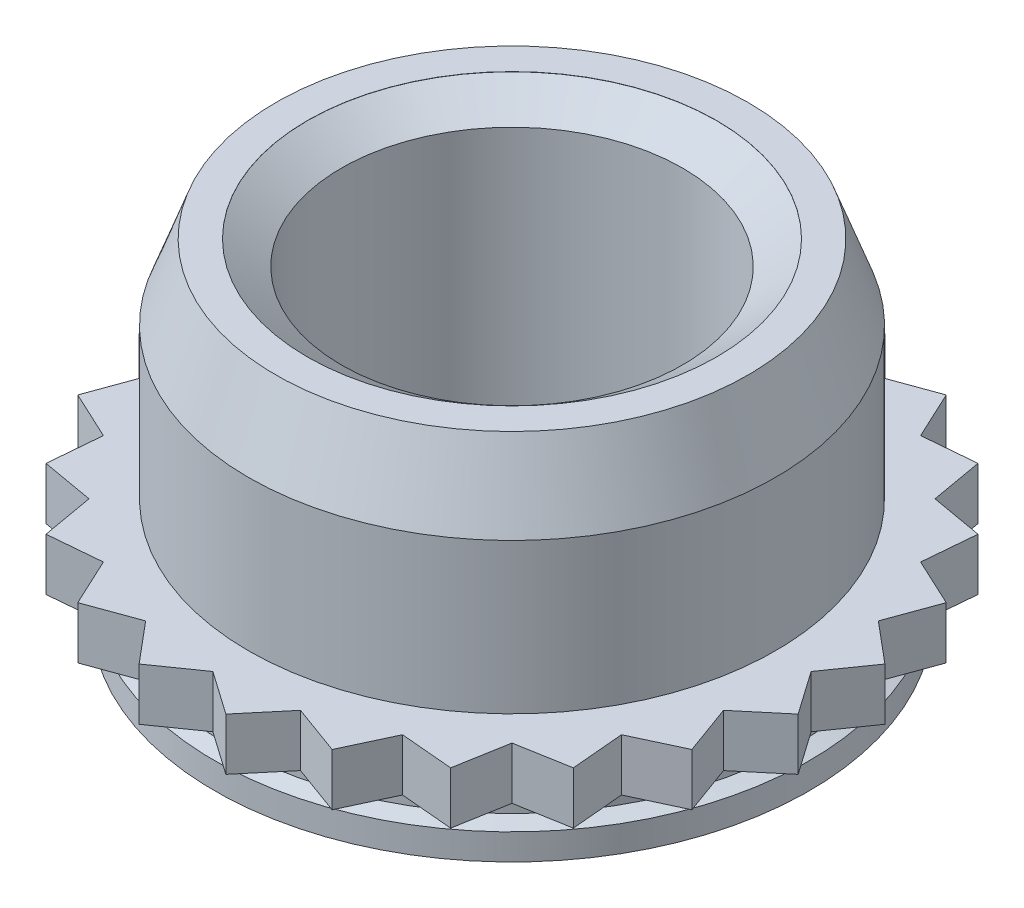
from build123d import *

# Parameters (mm, degrees)
CLINCHCUT_START    = -0.765
CLINCHCUT_DEPTH    = 0.765
CLINCHCUTPAT_COUNT = 24
CLINCHCUTPAT_ANGLE = 345


with BuildPart() as part:
    # BodySke → Body (revolve)
    with BuildSketch(Plane.XY, mode=Mode.PRIVATE) as body_sk:
        Polygon((4.13725, -1.068245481), (4.13725, -0.765), (4.87, -0.765), (4.87, 0), (3.86, 0), (3.86, 2.2), (3.459632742, 3.3), (2.5, 3.3), (2.5, -1.53), (4.355, -1.53), (4.355, -1.1475), align=None)
    revolve(body_sk.sketch.rotate(Axis((0, 0, 0), (0, 1, 0)), 90), axis=Axis((0, 0, 0), (0, 1, 0)))

    # EndChamferSke → EndChamfer (revolve, cut)
    with BuildSketch(Plane.XY, mode=Mode.PRIVATE) as endchamfer_sk:
        Polygon((3, -1.784), (3, -1.52746), (2.5, -1.177486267), (2.5, -1.784), align=None)
        Polygon((3, 3.29746), (3, 3.554), (2.5, 3.554), (2.5, 2.947486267), align=None)
    revolve(endchamfer_sk.sketch.rotate(Axis((0, -2.54, 0), (0, 1, 0)), 90), axis=Axis((0, -2.54, 0), (0, 1, 0)), mode=Mode.SUBTRACT)

    # CliRinCutSke → ClinchCut (cut)
    with BuildSketch(Plane.XZ.offset(0.765).offset(CLINCHCUT_START)):
        with BuildLine():
            Line((0.635662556, 4.828336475), (0, 4.383))
            Line((0, 4.383), (-0.635662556, 4.828336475))
            ThreePointArc((-0.635662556, 4.828336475), (0, 4.87), (0.635662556, 4.828336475))
        make_face()
    clinchcut = extrude(amount=CLINCHCUT_DEPTH, mode=Mode.SUBTRACT)

    # ClinchCutPat: ClinchCut ×24 about axis
    clinchcutpat_axis = Axis((0, 0, 0), (0, 1, 0))
    for i in range(1, CLINCHCUTPAT_COUNT):
        add(clinchcut.rotate(clinchcutpat_axis, i * CLINCHCUTPAT_ANGLE / (CLINCHCUTPAT_COUNT - 1)), mode=Mode.SUBTRACT)


solid = part.part
